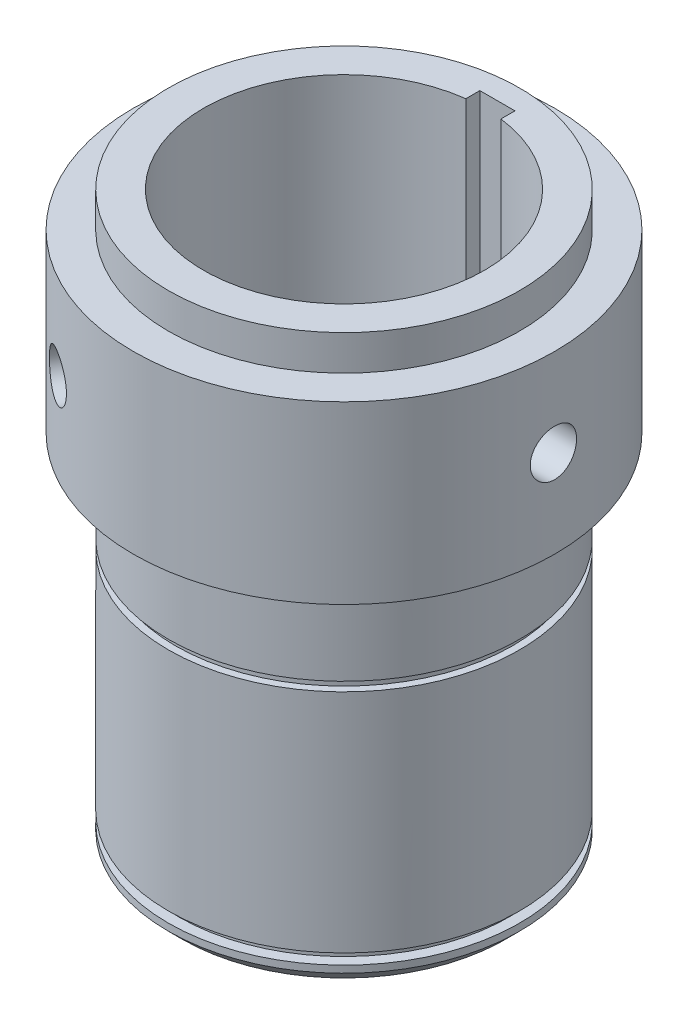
ISO-10303-21;
HEADER;
FILE_DESCRIPTION(('STEP AP214'),'2;1');
FILE_NAME('part.step','',(''),(''),'','','');
FILE_SCHEMA(('AUTOMOTIVE_DESIGN { 1 0 10303 214 1 1 1 1 }'));
ENDSEC;
DATA;
#1=APPLICATION_CONTEXT('core data for automotive mechanical design processes');
#2=APPLICATION_PROTOCOL_DEFINITION('international standard','automotive_design',2000,#1);
#3=PRODUCT_CONTEXT('',#1,'mechanical');
#4=PRODUCT('Part','Part','',(#3));
#5=PRODUCT_RELATED_PRODUCT_CATEGORY('part','',(#4));
#6=PRODUCT_DEFINITION_FORMATION('','',#4);
#7=PRODUCT_DEFINITION_CONTEXT('part definition',#1,'design');
#8=PRODUCT_DEFINITION('design','',#6,#7);
#9=PRODUCT_DEFINITION_SHAPE('','',#8);
#10=(LENGTH_UNIT() NAMED_UNIT(*) SI_UNIT(.MILLI.,.METRE.));
#11=(NAMED_UNIT(*) PLANE_ANGLE_UNIT() SI_UNIT($,.RADIAN.));
#12=(NAMED_UNIT(*) SI_UNIT($,.STERADIAN.) SOLID_ANGLE_UNIT());
#13=UNCERTAINTY_MEASURE_WITH_UNIT(LENGTH_MEASURE(1.E-05),#10,'distance_accuracy_value','');
#14=(GEOMETRIC_REPRESENTATION_CONTEXT(3) GLOBAL_UNCERTAINTY_ASSIGNED_CONTEXT((#13)) GLOBAL_UNIT_ASSIGNED_CONTEXT((#10,
#11,#12)) REPRESENTATION_CONTEXT('',''));
#15=CARTESIAN_POINT('',(0.,0.,0.));
#16=DIRECTION('',(0.,0.,1.));
#17=DIRECTION('',(1.,0.,0.));
#18=AXIS2_PLACEMENT_3D('',#15,#16,#17);
#19=CARTESIAN_POINT('',(0.,69.8663413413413,0.));
#20=DIRECTION('',(0.,1.,0.));
#21=DIRECTION('',(0.,0.,1.));
#22=AXIS2_PLACEMENT_3D('',#19,#20,#21);
#23=CYLINDRICAL_SURFACE('',#22,25.);
#24=CARTESIAN_POINT('',(0.,0.553415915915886,0.));
#25=DIRECTION('',(0.,1.,0.));
#26=DIRECTION('',(0.,0.,1.));
#27=AXIS2_PLACEMENT_3D('',#24,#25,#26);
#28=CIRCLE('',#27,25.);
#29=CARTESIAN_POINT('',(0.,0.553415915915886,25.));
#30=VERTEX_POINT('',#29);
#31=EDGE_CURVE('E124',#30,#30,#28,.T.);
#32=ORIENTED_EDGE('',*,*,#31,.F.);
#33=EDGE_LOOP('',(#32));
#34=FACE_BOUND('',#33,.T.);
#35=CARTESIAN_POINT('',(0.,-12.4465840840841,0.));
#36=DIRECTION('',(0.,-1.,0.));
#37=DIRECTION('',(0.,0.,-1.));
#38=AXIS2_PLACEMENT_3D('',#35,#36,#37);
#39=CIRCLE('',#38,25.);
#40=CARTESIAN_POINT('',(0.,-12.4465840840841,-25.));
#41=VERTEX_POINT('',#40);
#42=EDGE_CURVE('E250',#41,#41,#39,.T.);
#43=ORIENTED_EDGE('',*,*,#42,.F.);
#44=EDGE_LOOP('',(#43));
#45=FACE_BOUND('',#44,.T.);
#46=ADVANCED_FACE('F32',(#34,#45),#23,.T.);
#47=CARTESIAN_POINT('',(25.,-45.9465840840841,0.));
#48=DIRECTION('',(0.,1.,0.));
#49=DIRECTION('',(0.,0.,1.));
#50=AXIS2_PLACEMENT_3D('',#47,#48,#49);
#51=PLANE('',#50);
#52=CARTESIAN_POINT('',(0.,-45.9465840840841,0.));
#53=DIRECTION('',(0.,1.,0.));
#54=DIRECTION('',(0.,0.,1.));
#55=AXIS2_PLACEMENT_3D('',#52,#53,#54);
#56=CIRCLE('',#55,25.);
#57=CARTESIAN_POINT('',(0.,-45.9465840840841,25.));
#58=VERTEX_POINT('',#57);
#59=EDGE_CURVE('E127',#58,#58,#56,.T.);
#60=ORIENTED_EDGE('',*,*,#59,.F.);
#61=EDGE_LOOP('',(#60));
#62=FACE_BOUND('',#61,.T.);
#63=CARTESIAN_POINT('',(0.,-45.9465840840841,0.));
#64=DIRECTION('',(0.,1.,0.));
#65=DIRECTION('',(0.,0.,1.));
#66=AXIS2_PLACEMENT_3D('',#63,#64,#65);
#67=CIRCLE('',#66,23.5);
#68=CARTESIAN_POINT('',(0.,-45.9465840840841,23.5));
#69=VERTEX_POINT('',#68);
#70=EDGE_CURVE('E219',#69,#69,#67,.T.);
#71=ORIENTED_EDGE('',*,*,#70,.T.);
#72=EDGE_LOOP('',(#71));
#73=FACE_BOUND('',#72,.T.);
#74=ADVANCED_FACE('F196',(#62,#73),#51,.F.);
#75=CARTESIAN_POINT('',(0.,-13.7465840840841,0.));
#76=DIRECTION('',(0.,-1.,0.));
#77=DIRECTION('',(0.,0.,-1.));
#78=AXIS2_PLACEMENT_3D('',#75,#76,#77);
#79=CIRCLE('',#78,25.);
#80=CARTESIAN_POINT('',(0.,-13.7465840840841,-25.));
#81=VERTEX_POINT('',#80);
#82=EDGE_CURVE('E36',#81,#81,#79,.T.);
#83=ORIENTED_EDGE('',*,*,#82,.T.);
#84=EDGE_LOOP('',(#83));
#85=FACE_BOUND('',#84,.T.);
#86=ORIENTED_EDGE('',*,*,#59,.T.);
#87=EDGE_LOOP('',(#86));
#88=FACE_BOUND('',#87,.T.);
#89=ADVANCED_FACE('F199',(#85,#88),#23,.T.);
#90=CARTESIAN_POINT('',(25.,0.553415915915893,0.));
#91=DIRECTION('',(0.,1.,0.));
#92=DIRECTION('',(0.,0.,1.));
#93=AXIS2_PLACEMENT_3D('',#90,#91,#92);
#94=PLANE('',#93);
#95=CARTESIAN_POINT('',(0.,0.553415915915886,0.));
#96=DIRECTION('',(0.,1.,0.));
#97=DIRECTION('',(0.,0.,1.));
#98=AXIS2_PLACEMENT_3D('',#95,#96,#97);
#99=CIRCLE('',#98,30.);
#100=CARTESIAN_POINT('',(0.,0.553415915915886,30.));
#101=VERTEX_POINT('',#100);
#102=EDGE_CURVE('E121',#101,#101,#99,.T.);
#103=ORIENTED_EDGE('',*,*,#102,.F.);
#104=EDGE_LOOP('',(#103));
#105=FACE_BOUND('',#104,.T.);
#106=ORIENTED_EDGE('',*,*,#31,.T.);
#107=EDGE_LOOP('',(#106));
#108=FACE_BOUND('',#107,.T.);
#109=ADVANCED_FACE('F191',(#105,#108),#94,.F.);
#110=CARTESIAN_POINT('',(0.,69.8663413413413,0.));
#111=DIRECTION('',(0.,1.,0.));
#112=DIRECTION('',(0.,0.,1.));
#113=AXIS2_PLACEMENT_3D('',#110,#111,#112);
#114=CYLINDRICAL_SURFACE('',#113,30.);
#115=CARTESIAN_POINT('',(-17.7668576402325,13.0534159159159,-24.1731001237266));
#116=CARTESIAN_POINT('',(-17.7668519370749,12.8686560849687,-24.1731061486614));
#117=CARTESIAN_POINT('',(-17.7542425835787,12.6837765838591,-24.1823877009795));
#118=CARTESIAN_POINT('',(-17.7040634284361,12.3191506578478,-24.2191467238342));
#119=CARTESIAN_POINT('',(-17.6664666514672,12.1394099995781,-24.2466438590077));
#120=CARTESIAN_POINT('',(-17.5672126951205,11.7903944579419,-24.3186507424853));
#121=CARTESIAN_POINT('',(-17.5055707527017,11.6211130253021,-24.363149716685));
#122=CARTESIAN_POINT('',(-17.3596823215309,11.2976813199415,-24.4673133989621));
#123=CARTESIAN_POINT('',(-17.275440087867,11.1435282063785,-24.5269752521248));
#124=CARTESIAN_POINT('',(-17.0859462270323,10.8540209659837,-24.6593554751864));
#125=CARTESIAN_POINT('',(-16.9806141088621,10.7187423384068,-24.7321237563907));
#126=CARTESIAN_POINT('',(-16.7516564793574,10.4714750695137,-24.887770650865));
#127=CARTESIAN_POINT('',(-16.6280301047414,10.3594875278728,-24.9706497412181));
#128=CARTESIAN_POINT('',(-16.3651833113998,10.1617161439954,-25.1436981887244));
#129=CARTESIAN_POINT('',(-16.2259239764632,10.0759997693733,-25.2338855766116));
#130=CARTESIAN_POINT('',(-15.9356469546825,9.93363568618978,-25.418195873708));
#131=CARTESIAN_POINT('',(-15.7846296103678,9.87698713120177,-25.5123186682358));
#132=CARTESIAN_POINT('',(-15.47552421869,9.79458994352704,-25.7009880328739));
#133=CARTESIAN_POINT('',(-15.3174674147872,9.76871661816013,-25.7955313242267));
#134=CARTESIAN_POINT('',(-14.9981162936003,9.74821828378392,-25.9825082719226));
#135=CARTESIAN_POINT('',(-14.8368220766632,9.75359230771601,-26.0749419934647));
#136=CARTESIAN_POINT('',(-14.516338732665,9.79533538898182,-26.2547049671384));
#137=CARTESIAN_POINT('',(-14.3571435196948,9.83157035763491,-26.3420545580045));
#138=CARTESIAN_POINT('',(-14.0448109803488,9.93379759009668,-26.5098988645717));
#139=CARTESIAN_POINT('',(-13.89167374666,9.99979030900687,-26.5903934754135));
#140=CARTESIAN_POINT('',(-13.5957161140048,10.1598051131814,-26.7429300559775));
#141=CARTESIAN_POINT('',(-13.4529181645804,10.2538860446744,-26.8149538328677));
#142=CARTESIAN_POINT('',(-13.1823399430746,10.4673639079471,-26.949002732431));
#143=CARTESIAN_POINT('',(-13.0545602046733,10.5867617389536,-27.0110274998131));
#144=CARTESIAN_POINT('',(-12.8173587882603,10.8482371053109,-27.1243935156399));
#145=CARTESIAN_POINT('',(-12.708037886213,10.9904313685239,-27.1756764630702));
#146=CARTESIAN_POINT('',(-12.5120979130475,11.2930599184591,-27.2664464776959));
#147=CARTESIAN_POINT('',(-12.4254788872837,11.453494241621,-27.305933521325));
#148=CARTESIAN_POINT('',(-12.2777859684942,11.78814356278,-27.3726610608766));
#149=CARTESIAN_POINT('',(-12.2167192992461,11.9623624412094,-27.3998980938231));
#150=CARTESIAN_POINT('',(-12.1222487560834,12.319587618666,-27.4418253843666));
#151=CARTESIAN_POINT('',(-12.0888438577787,12.5025935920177,-27.4565161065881));
#152=CARTESIAN_POINT('',(-12.0509547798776,12.8711737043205,-27.4731673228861));
#153=CARTESIAN_POINT('',(-12.0463203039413,13.0567294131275,-27.4751939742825));
#154=CARTESIAN_POINT('',(-12.0657319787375,13.4260404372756,-27.4666747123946));
#155=CARTESIAN_POINT('',(-12.0897776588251,13.609795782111,-27.4561290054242));
#156=CARTESIAN_POINT('',(-12.1656185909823,13.9698091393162,-27.4226077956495));
#157=CARTESIAN_POINT('',(-12.2173423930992,14.1460852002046,-27.3996642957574));
#158=CARTESIAN_POINT('',(-12.3467464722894,14.4866985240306,-27.3415956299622));
#159=CARTESIAN_POINT('',(-12.4244274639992,14.6510354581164,-27.3064701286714));
#160=CARTESIAN_POINT('',(-12.6035591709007,14.9638476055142,-27.2242540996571));
#161=CARTESIAN_POINT('',(-12.705106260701,15.1122548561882,-27.1771149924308));
#162=CARTESIAN_POINT('',(-12.9285253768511,15.3883041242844,-27.0715433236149));
#163=CARTESIAN_POINT('',(-13.0503980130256,15.5159455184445,-27.0131104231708));
#164=CARTESIAN_POINT('',(-13.311215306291,15.7474066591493,-26.8855476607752));
#165=CARTESIAN_POINT('',(-13.4502323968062,15.8511196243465,-26.8163720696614));
#166=CARTESIAN_POINT('',(-13.7405989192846,16.0310435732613,-26.6687538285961));
#167=CARTESIAN_POINT('',(-13.8919481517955,16.1072550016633,-26.5903113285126));
#168=CARTESIAN_POINT('',(-14.2020318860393,16.2298332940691,-26.4259907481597));
#169=CARTESIAN_POINT('',(-14.3607499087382,16.2762636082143,-26.3401289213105));
#170=CARTESIAN_POINT('',(-14.6811273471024,16.3381685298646,-26.1629125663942));
#171=CARTESIAN_POINT('',(-14.8427866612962,16.3536442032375,-26.0715582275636));
#172=CARTESIAN_POINT('',(-15.163479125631,16.3531837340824,-25.8863479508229));
#173=CARTESIAN_POINT('',(-15.3225216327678,16.3374129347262,-25.7925077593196));
#174=CARTESIAN_POINT('',(-15.6344015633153,16.2752552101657,-25.6046605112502));
#175=CARTESIAN_POINT('',(-15.7872389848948,16.2288682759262,-25.5106534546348));
#176=CARTESIAN_POINT('',(-16.0825711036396,16.1068432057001,-25.3255069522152));
#177=CARTESIAN_POINT('',(-16.2250679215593,16.0312110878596,-25.2343669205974));
#178=CARTESIAN_POINT('',(-16.4960971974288,15.8528598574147,-25.0580316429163));
#179=CARTESIAN_POINT('',(-16.6246296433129,15.7501407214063,-24.9728364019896));
#180=CARTESIAN_POINT('',(-16.8651820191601,15.5199138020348,-24.8110215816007));
#181=CARTESIAN_POINT('',(-16.9771148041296,15.3922828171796,-24.7344477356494));
#182=CARTESIAN_POINT('',(-17.1810152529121,15.1161048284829,-24.5932539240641));
#183=CARTESIAN_POINT('',(-17.2729781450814,14.9675528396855,-24.5286368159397));
#184=CARTESIAN_POINT('',(-17.4349755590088,14.6532472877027,-24.4137573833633));
#185=CARTESIAN_POINT('',(-17.5049429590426,14.4874430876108,-24.3635390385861));
#186=CARTESIAN_POINT('',(-17.6208529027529,14.1438040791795,-24.279841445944));
#187=CARTESIAN_POINT('',(-17.6668221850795,13.9659829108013,-24.2463435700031));
#188=CARTESIAN_POINT('',(-17.7224023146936,13.6648909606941,-24.2057258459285));
#189=CARTESIAN_POINT('',(-17.7390537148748,13.5435361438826,-24.1935149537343));
#190=CARTESIAN_POINT('',(-17.7612832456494,13.2992771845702,-24.177200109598));
#191=CARTESIAN_POINT('',(-17.7668614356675,13.1763730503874,-24.1730961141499));
#192=CARTESIAN_POINT('',(-17.7668576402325,13.0534159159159,-24.1731001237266));
#193=B_SPLINE_CURVE_WITH_KNOTS('',3,(#115,#116,#117,#118,#119,#120,#121,#122,#123,#124,#125,
#126,#127,#128,#129,#130,#131,#132,#133,#134,#135,#136,#137,#138,#139,#140,#141,#142,#143,#144,
#145,#146,#147,#148,#149,#150,#151,#152,#153,#154,#155,#156,#157,#158,#159,#160,#161,#162,#163,
#164,#165,#166,#167,#168,#169,#170,#171,#172,#173,#174,#175,#176,#177,#178,#179,#180,#181,#182,
#183,#184,#185,#186,#187,#188,#189,#190,#191,#192),.UNSPECIFIED.,.T.,.F.,(4,2,2,2,2,2,2,2,2,2,2,
2,2,2,2,2,2,2,2,2,2,2,2,2,2,2,2,2,2,2,2,2,2,2,2,2,2,2,4),(0.,0.553830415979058,1.1082596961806,
1.6623382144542,2.21631248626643,2.77244278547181,3.32859933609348,3.88617242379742,
4.44372927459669,4.99901928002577,5.55429210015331,6.1071645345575,6.66004542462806,
7.21409285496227,7.76815996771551,8.32516051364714,8.88216217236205,9.43932119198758,
9.99645957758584,10.5506850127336,11.1049013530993,11.6576938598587,12.2105015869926,
12.7655811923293,13.3206774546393,13.8782049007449,14.4357233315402,14.992049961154,
15.5483574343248,16.1017290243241,16.6551007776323,17.2083587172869,17.7616171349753,
18.3176843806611,18.8738843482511,19.4317655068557,19.9890237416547,20.3575982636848,
20.7261708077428),.UNSPECIFIED.);
#194=CARTESIAN_POINT('',(-17.7668576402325,13.0534159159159,-24.1731001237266));
#195=VERTEX_POINT('',#194);
#196=EDGE_CURVE('E12',#195,#195,#193,.T.);
#197=ORIENTED_EDGE('',*,*,#196,.T.);
#198=EDGE_LOOP('',(#197));
#199=FACE_BOUND('',#198,.T.);
#200=CARTESIAN_POINT('',(-12.0510899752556,13.0534159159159,27.4731001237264));
#201=CARTESIAN_POINT('',(-12.051098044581,12.8686560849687,27.4730981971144));
#202=CARTESIAN_POINT('',(-12.0654407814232,12.6837765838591,27.4668189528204));
#203=CARTESIAN_POINT('',(-12.1223646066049,12.3191506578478,27.4417420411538));
#204=CARTESIAN_POINT('',(-12.1649762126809,12.1394099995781,27.4229308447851));
#205=CARTESIAN_POINT('',(-12.2769629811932,11.7903944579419,27.3729778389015));
#206=CARTESIAN_POINT('',(-12.3463211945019,11.6211130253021,27.3418438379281));
#207=CARTESIAN_POINT('',(-12.509473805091,11.2976813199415,27.2675825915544));
#208=CARTESIAN_POINT('',(-12.6032636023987,11.1435282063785,27.2244576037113));
#209=CARTESIAN_POINT('',(-12.812655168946,10.8540209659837,27.1265412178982));
#210=CARTESIAN_POINT('',(-12.9283404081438,10.7187423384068,27.0717050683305));
#211=CARTESIAN_POINT('',(-13.1776133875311,10.4714750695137,26.9512453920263));
#212=CARTESIAN_POINT('',(-13.3112019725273,10.3594875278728,26.8856213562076));
#213=CARTESIAN_POINT('',(-13.5924897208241,10.1617161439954,26.7445135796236));
#214=CARTESIAN_POINT('',(-13.7402239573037,10.0759997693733,26.669005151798));
#215=CARTESIAN_POINT('',(-14.0449798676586,9.93363568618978,26.5097730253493));
#216=CARTESIAN_POINT('',(-14.2020012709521,9.87698713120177,26.4260495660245));
#217=CARTESIAN_POINT('',(-14.5199464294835,9.79458994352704,26.2526911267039));
#218=CARTESIAN_POINT('',(-14.6808517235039,9.76871661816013,26.1630815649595));
#219=CARTESIAN_POINT('',(-15.002454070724,9.74821828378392,25.9800038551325));
#220=CARTESIAN_POINT('',(-15.1631511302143,9.75359230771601,25.8865358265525));
#221=CARTESIAN_POINT('',(-15.4790721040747,9.79533538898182,25.6988705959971));
#222=CARTESIAN_POINT('',(-15.63431667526,9.83157035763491,25.6046782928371));
#223=CARTESIAN_POINT('',(-15.9358403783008,9.93379759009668,25.4181125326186));
#224=CARTESIAN_POINT('',(-16.082119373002,9.99979030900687,25.3257391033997));
#225=CARTESIAN_POINT('',(-16.3621987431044,10.1598051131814,25.1457005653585));
#226=CARTESIAN_POINT('',(-16.49597213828,10.2538860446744,25.0580458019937));
#227=CARTESIAN_POINT('',(-16.7473510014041,10.4673639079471,24.8907426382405));
#228=CARTESIAN_POINT('',(-16.8649558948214,10.5867617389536,24.8110945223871));
#229=CARTESIAN_POINT('',(-17.0817344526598,10.8482371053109,24.6623550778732));
#230=CARTESIAN_POINT('',(-17.1808072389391,10.9904313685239,24.5933218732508));
#231=CARTESIAN_POINT('',(-17.3573863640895,11.2930599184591,24.4690178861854));
#232=CARTESIAN_POINT('',(-17.4348926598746,11.453494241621,24.4137471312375));
#233=CARTESIAN_POINT('',(-17.566526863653,11.78814356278,24.3192050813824));
#234=CARTESIAN_POINT('',(-17.6206481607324,11.9623624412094,24.2799383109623));
#235=CARTESIAN_POINT('',(-17.7041935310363,12.319587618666,24.2190880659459));
#236=CARTESIAN_POINT('',(-17.7336185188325,12.5025935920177,24.197503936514));
#237=CARTESIAN_POINT('',(-17.7669834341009,12.8711737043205,24.1730166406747));
#238=CARTESIAN_POINT('',(-17.771055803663,13.0567294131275,24.1700163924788));
#239=CARTESIAN_POINT('',(-17.7539720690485,13.4260404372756,24.1825677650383));
#240=CARTESIAN_POINT('',(-17.7328163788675,13.609795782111,24.1981190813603));
#241=CARTESIAN_POINT('',(-17.6658656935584,13.9698091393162,24.2470386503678));
#242=CARTESIAN_POINT('',(-17.6201341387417,14.1460852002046,24.2803610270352));
#243=CARTESIAN_POINT('',(-17.5051431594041,14.4866985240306,24.3633939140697));
#244=CARTESIAN_POINT('',(-17.4358830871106,14.6510354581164,24.4131048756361));
#245=CARTESIAN_POINT('',(-17.2751160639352,14.9638476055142,24.527129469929));
#246=CARTESIAN_POINT('',(-17.1835188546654,15.1122548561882,24.5915022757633));
#247=CARTESIAN_POINT('',(-16.9803815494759,15.3883041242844,24.7322030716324));
#248=CARTESIAN_POINT('',(-16.8688408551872,15.5159455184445,24.8085314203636));
#249=CARTESIAN_POINT('',(-16.627959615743,15.7474066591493,24.9706244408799));
#250=CARTESIAN_POINT('',(-16.498543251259,15.8511196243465,25.0564289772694));
#251=CARTESIAN_POINT('',(-16.2255188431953,16.0310435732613,25.2340846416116));
#252=CARTESIAN_POINT('',(-16.0819110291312,16.1072550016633,25.3259356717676));
#253=CARTESIAN_POINT('',(-15.7845633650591,16.2298332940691,25.5123157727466));
#254=CARTESIAN_POINT('',(-15.6308458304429,16.2762636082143,25.6068386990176));
#255=CARTESIAN_POINT('',(-15.3171832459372,16.3381685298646,25.7956855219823));
#256=CARTESIAN_POINT('',(-15.1572384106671,16.3536442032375,25.8900094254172));
#257=CARTESIAN_POINT('',(-14.8364953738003,16.3531837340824,26.075132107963));
#258=CARTESIAN_POINT('',(-14.6757061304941,16.3374129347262,26.1659468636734));
#259=CARTESIAN_POINT('',(-14.3570856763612,16.2752552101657,26.3421191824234));
#260=CARTESIAN_POINT('',(-14.1992544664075,16.2288682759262,26.4274767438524));
#261=CARTESIAN_POINT('',(-13.8912468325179,16.1068432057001,26.5906686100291));
#262=CARTESIAN_POINT('',(-13.7410688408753,16.0312110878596,26.6685044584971));
#263=CARTESIAN_POINT('',(-13.4528433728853,15.8528598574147,26.8150550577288));
#264=CARTESIAN_POINT('',(-13.3147959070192,15.7501407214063,26.8837698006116));
#265=CARTESIAN_POINT('',(-13.05438397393,15.5199138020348,27.0111868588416));
#266=CARTESIAN_POINT('',(-12.9321026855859,15.3922828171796,27.0698365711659));
#267=CARTESIAN_POINT('',(-12.7078750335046,15.1161048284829,27.1758226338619));
#268=CARTESIAN_POINT('',(-12.6059335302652,14.9675528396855,27.2231562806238));
#269=CARTESIAN_POINT('',(-12.425446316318,14.6532472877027,27.3060104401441));
#270=CARTESIAN_POINT('',(-12.346972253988,14.4874430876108,27.3414948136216));
#271=CARTESIAN_POINT('',(-12.2165330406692,14.1438040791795,27.4000269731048));
#272=CARTESIAN_POINT('',(-12.1645383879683,13.9659829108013,27.4230886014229));
#273=CARTESIAN_POINT('',(-12.1015723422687,13.6648909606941,27.4509135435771));
#274=CARTESIAN_POINT('',(-12.0826716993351,13.5435361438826,27.4592286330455));
#275=CARTESIAN_POINT('',(-12.0574278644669,13.2992771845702,27.4703225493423));
#276=CARTESIAN_POINT('',(-12.0510846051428,13.1763730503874,27.4731014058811));
#277=CARTESIAN_POINT('',(-12.0510899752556,13.0534159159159,27.4731001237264));
#278=B_SPLINE_CURVE_WITH_KNOTS('',3,(#200,#201,#202,#203,#204,#205,#206,#207,#208,#209,#210,
#211,#212,#213,#214,#215,#216,#217,#218,#219,#220,#221,#222,#223,#224,#225,#226,#227,#228,#229,
#230,#231,#232,#233,#234,#235,#236,#237,#238,#239,#240,#241,#242,#243,#244,#245,#246,#247,#248,
#249,#250,#251,#252,#253,#254,#255,#256,#257,#258,#259,#260,#261,#262,#263,#264,#265,#266,#267,
#268,#269,#270,#271,#272,#273,#274,#275,#276,#277),.UNSPECIFIED.,.T.,.F.,(4,2,2,2,2,2,2,2,2,2,2,
2,2,2,2,2,2,2,2,2,2,2,2,2,2,2,2,2,2,2,2,2,2,2,2,2,2,2,4),(0.,0.553830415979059,1.1082596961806,
1.6623382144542,2.21631248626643,2.77244278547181,3.32859933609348,3.88617242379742,
4.44372927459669,4.99901928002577,5.55429210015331,6.1071645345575,6.66004542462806,
7.21409285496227,7.76815996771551,8.32516051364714,8.88216217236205,9.43932119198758,
9.99645957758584,10.5506850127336,11.1049013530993,11.6576938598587,12.2105015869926,
12.7655811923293,13.3206774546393,13.8782049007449,14.4357233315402,14.992049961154,
15.5483574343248,16.1017290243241,16.6551007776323,17.2083587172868,17.7616171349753,
18.3176843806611,18.8738843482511,19.4317655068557,19.9890237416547,20.3575982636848,
20.7261708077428),.UNSPECIFIED.);
#279=CARTESIAN_POINT('',(-12.0510899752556,13.0534159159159,27.4731001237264));
#280=VERTEX_POINT('',#279);
#281=EDGE_CURVE('E41',#280,#280,#278,.T.);
#282=ORIENTED_EDGE('',*,*,#281,.T.);
#283=EDGE_LOOP('',(#282));
#284=FACE_BOUND('',#283,.T.);
#285=CARTESIAN_POINT('',(29.8179476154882,13.0534159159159,-3.29999999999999));
#286=CARTESIAN_POINT('',(29.817949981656,12.8686560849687,-3.29999204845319));
#287=CARTESIAN_POINT('',(29.819683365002,12.6837765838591,-3.28443125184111));
#288=CARTESIAN_POINT('',(29.8264280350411,12.3191506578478,-3.22259531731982));
#289=CARTESIAN_POINT('',(29.8314428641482,12.1394099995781,-3.17628698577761));
#290=CARTESIAN_POINT('',(29.8441756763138,11.7903944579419,-3.05432709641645));
#291=CARTESIAN_POINT('',(29.8518919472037,11.6211130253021,-2.97869412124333));
#292=CARTESIAN_POINT('',(29.8691561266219,11.2976813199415,-2.80026919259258));
#293=CARTESIAN_POINT('',(29.8787036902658,11.1435282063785,-2.69748235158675));
#294=CARTESIAN_POINT('',(29.8986013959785,10.8540209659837,-2.46718574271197));
#295=CARTESIAN_POINT('',(29.908954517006,10.7187423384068,-2.33958131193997));
#296=CARTESIAN_POINT('',(29.9292698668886,10.4714750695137,-2.06347474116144));
#297=CARTESIAN_POINT('',(29.9392320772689,10.3594875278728,-1.91497161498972));
#298=CARTESIAN_POINT('',(29.957673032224,10.1617161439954,-1.60081539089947));
#299=CARTESIAN_POINT('',(29.9661479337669,10.0759997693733,-1.43511957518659));
#300=CARTESIAN_POINT('',(29.9806268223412,9.93363568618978,-1.09157715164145));
#301=CARTESIAN_POINT('',(29.98663088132,9.87698713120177,-0.913730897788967));
#302=CARTESIAN_POINT('',(29.9954706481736,9.79458994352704,-0.551703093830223));
#303=CARTESIAN_POINT('',(29.9983191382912,9.76871661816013,-0.367550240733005));
#304=CARTESIAN_POINT('',(30.0005703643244,9.74821828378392,0.00250441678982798));
#305=CARTESIAN_POINT('',(29.9999732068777,9.75359230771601,0.188406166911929));
#306=CARTESIAN_POINT('',(29.9954108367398,9.79533538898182,0.555834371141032));
#307=CARTESIAN_POINT('',(29.9914601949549,9.83157035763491,0.737376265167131));
#308=CARTESIAN_POINT('',(29.9806513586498,9.93379759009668,1.09178633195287));
#309=CARTESIAN_POINT('',(29.9737931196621,9.99979030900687,1.2646543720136));
#310=CARTESIAN_POINT('',(29.9579148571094,10.1598051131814,1.59722949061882));
#311=CARTESIAN_POINT('',(29.9488903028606,10.2538860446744,1.75690803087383));
#312=CARTESIAN_POINT('',(29.9296909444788,10.4673639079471,2.05826009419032));
#313=CARTESIAN_POINT('',(29.9195160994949,10.5867617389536,2.19993297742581));
#314=CARTESIAN_POINT('',(29.8990932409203,10.8482371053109,2.46203843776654));
#315=CARTESIAN_POINT('',(29.8888451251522,10.9904313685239,2.5823545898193));
#316=CARTESIAN_POINT('',(29.8694842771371,11.2930599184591,2.79742859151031));
#317=CARTESIAN_POINT('',(29.8603715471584,11.453494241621,2.89218639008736));
#318=CARTESIAN_POINT('',(29.8443128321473,11.78814356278,3.05345597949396));
#319=CARTESIAN_POINT('',(29.8373674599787,11.9623624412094,3.11995978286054));
#320=CARTESIAN_POINT('',(29.8264422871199,12.319587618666,3.22273731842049));
#321=CARTESIAN_POINT('',(29.8224623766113,12.5025935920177,3.25901217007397));
#322=CARTESIAN_POINT('',(29.8179382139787,12.8711737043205,3.30015068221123));
#323=CARTESIAN_POINT('',(29.8173761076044,13.0567294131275,3.30517758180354));
#324=CARTESIAN_POINT('',(29.8197040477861,13.4260404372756,3.28410694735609));
#325=CARTESIAN_POINT('',(29.8225940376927,13.609795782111,3.25800992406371));
#326=CARTESIAN_POINT('',(29.8314842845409,13.9698091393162,3.17556914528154));
#327=CARTESIAN_POINT('',(29.837476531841,14.1460852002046,3.11930326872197));
#328=CARTESIAN_POINT('',(29.8518896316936,14.4866985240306,2.9782017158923));
#329=CARTESIAN_POINT('',(29.8603105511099,14.6510354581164,2.89336525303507));
#330=CARTESIAN_POINT('',(29.8786752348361,14.9638476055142,2.69712462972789));
#331=CARTESIAN_POINT('',(29.8886251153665,15.1122548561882,2.58561271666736));
#332=CARTESIAN_POINT('',(29.9089069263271,15.3883041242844,2.33934025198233));
#333=CARTESIAN_POINT('',(29.9192388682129,15.5159455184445,2.20457900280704));
#334=CARTESIAN_POINT('',(29.9391749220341,15.7474066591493,1.91492321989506));
#335=CARTESIAN_POINT('',(29.9487756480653,15.8511196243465,1.75994309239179));
#336=CARTESIAN_POINT('',(29.9661177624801,16.0310435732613,1.43466918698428));
#337=CARTESIAN_POINT('',(29.9738591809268,16.1072550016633,1.2643756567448));
#338=CARTESIAN_POINT('',(29.9865952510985,16.2298332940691,0.913674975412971));
#339=CARTESIAN_POINT('',(29.9915957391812,16.2762636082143,0.73329022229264));
#340=CARTESIAN_POINT('',(29.9983105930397,16.3381685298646,0.367227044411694));
#341=CARTESIAN_POINT('',(30.0000250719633,16.3536442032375,0.181548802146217));
#342=CARTESIAN_POINT('',(29.9999744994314,16.3531837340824,-0.188784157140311));
#343=CARTESIAN_POINT('',(29.9982277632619,16.3374129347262,-0.373439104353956));
#344=CARTESIAN_POINT('',(29.9914872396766,16.2752552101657,-0.73745867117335));
#345=CARTESIAN_POINT('',(29.9864934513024,16.2288682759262,-0.916823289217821));
#346=CARTESIAN_POINT('',(29.9738179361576,16.1068432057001,-1.26516165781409));
#347=CARTESIAN_POINT('',(29.9661367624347,16.0312110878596,-1.43413753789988));
#348=CARTESIAN_POINT('',(29.9489405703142,15.8528598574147,-1.75702341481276));
#349=CARTESIAN_POINT('',(29.9394255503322,15.7501407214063,-1.91093339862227));
#350=CARTESIAN_POINT('',(29.9195659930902,15.5199138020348,-2.20016527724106));
#351=CARTESIAN_POINT('',(29.9092174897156,15.3922828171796,-2.33538883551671));
#352=CARTESIAN_POINT('',(29.8888902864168,15.1161048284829,-2.58256870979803));
#353=CARTESIAN_POINT('',(29.8789116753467,14.9675528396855,-2.69451946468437));
#354=CARTESIAN_POINT('',(29.8604218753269,14.6532472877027,-2.89225305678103));
#355=CARTESIAN_POINT('',(29.8519152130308,14.4874430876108,-2.97795577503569));
#356=CARTESIAN_POINT('',(29.8373859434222,14.1438040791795,-3.12018552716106));
#357=CARTESIAN_POINT('',(29.8313605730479,13.9659829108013,-3.17674503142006));
#358=CARTESIAN_POINT('',(29.8239746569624,13.6648909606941,-3.24518769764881));
#359=CARTESIAN_POINT('',(29.82172541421,13.5435361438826,-3.26571367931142));
#360=CARTESIAN_POINT('',(29.8187111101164,13.2992771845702,-3.29312243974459));
#361=CARTESIAN_POINT('',(29.8179460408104,13.1763730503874,-3.30000529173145));
#362=CARTESIAN_POINT('',(29.8179476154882,13.0534159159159,-3.29999999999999));
#363=B_SPLINE_CURVE_WITH_KNOTS('',3,(#285,#286,#287,#288,#289,#290,#291,#292,#293,#294,#295,
#296,#297,#298,#299,#300,#301,#302,#303,#304,#305,#306,#307,#308,#309,#310,#311,#312,#313,#314,
#315,#316,#317,#318,#319,#320,#321,#322,#323,#324,#325,#326,#327,#328,#329,#330,#331,#332,#333,
#334,#335,#336,#337,#338,#339,#340,#341,#342,#343,#344,#345,#346,#347,#348,#349,#350,#351,#352,
#353,#354,#355,#356,#357,#358,#359,#360,#361,#362),.UNSPECIFIED.,.T.,.F.,(4,2,2,2,2,2,2,2,2,2,2,
2,2,2,2,2,2,2,2,2,2,2,2,2,2,2,2,2,2,2,2,2,2,2,2,2,2,2,4),(0.,0.553830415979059,1.1082596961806,
1.6623382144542,2.21631248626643,2.77244278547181,3.32859933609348,3.88617242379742,
4.44372927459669,4.99901928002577,5.55429210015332,6.1071645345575,6.66004542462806,
7.21409285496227,7.76815996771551,8.32516051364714,8.88216217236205,9.43932119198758,
9.99645957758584,10.5506850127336,11.1049013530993,11.6576938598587,12.2105015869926,
12.7655811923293,13.3206774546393,13.8782049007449,14.4357233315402,14.992049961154,
15.5483574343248,16.101729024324,16.6551007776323,17.2083587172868,17.7616171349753,
18.3176843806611,18.8738843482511,19.4317655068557,19.9890237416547,20.3575982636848,
20.7261708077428),.UNSPECIFIED.);
#364=CARTESIAN_POINT('',(29.8179476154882,13.0534159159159,-3.29999999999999));
#365=VERTEX_POINT('',#364);
#366=EDGE_CURVE('E136',#365,#365,#363,.T.);
#367=ORIENTED_EDGE('',*,*,#366,.T.);
#368=EDGE_LOOP('',(#367));
#369=FACE_BOUND('',#368,.T.);
#370=CARTESIAN_POINT('',(0.,25.5534159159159,0.));
#371=DIRECTION('',(0.,1.,0.));
#372=DIRECTION('',(0.,0.,1.));
#373=AXIS2_PLACEMENT_3D('',#370,#371,#372);
#374=CIRCLE('',#373,30.);
#375=CARTESIAN_POINT('',(0.,25.5534159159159,30.));
#376=VERTEX_POINT('',#375);
#377=EDGE_CURVE('E118',#376,#376,#374,.T.);
#378=ORIENTED_EDGE('',*,*,#377,.F.);
#379=EDGE_LOOP('',(#378));
#380=FACE_BOUND('',#379,.T.);
#381=ORIENTED_EDGE('',*,*,#102,.T.);
#382=EDGE_LOOP('',(#381));
#383=FACE_BOUND('',#382,.T.);
#384=ADVANCED_FACE('F146',(#199,#284,#369,#380,#383),#114,.T.);
#385=CARTESIAN_POINT('',(30.,25.5534159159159,0.));
#386=DIRECTION('',(0.,-1.,0.));
#387=DIRECTION('',(0.,0.,-1.));
#388=AXIS2_PLACEMENT_3D('',#385,#386,#387);
#389=PLANE('',#388);
#390=CARTESIAN_POINT('',(0.,25.5534159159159,0.));
#391=DIRECTION('',(0.,1.,0.));
#392=DIRECTION('',(0.,0.,1.));
#393=AXIS2_PLACEMENT_3D('',#390,#391,#392);
#394=CIRCLE('',#393,25.);
#395=CARTESIAN_POINT('',(0.,25.5534159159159,25.));
#396=VERTEX_POINT('',#395);
#397=EDGE_CURVE('E115',#396,#396,#394,.T.);
#398=ORIENTED_EDGE('',*,*,#397,.F.);
#399=EDGE_LOOP('',(#398));
#400=FACE_BOUND('',#399,.T.);
#401=ORIENTED_EDGE('',*,*,#377,.T.);
#402=EDGE_LOOP('',(#401));
#403=FACE_BOUND('',#402,.T.);
#404=ADVANCED_FACE('F184',(#400,#403),#389,.F.);
#405=CARTESIAN_POINT('',(0.,69.8663413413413,0.));
#406=DIRECTION('',(0.,1.,0.));
#407=DIRECTION('',(0.,0.,1.));
#408=AXIS2_PLACEMENT_3D('',#405,#406,#407);
#409=CYLINDRICAL_SURFACE('',#408,25.);
#410=CARTESIAN_POINT('',(0.,30.5534159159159,0.));
#411=DIRECTION('',(0.,1.,0.));
#412=DIRECTION('',(0.,0.,1.));
#413=AXIS2_PLACEMENT_3D('',#410,#411,#412);
#414=CIRCLE('',#413,25.);
#415=CARTESIAN_POINT('',(0.,30.5534159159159,25.));
#416=VERTEX_POINT('',#415);
#417=EDGE_CURVE('E106',#416,#416,#414,.T.);
#418=ORIENTED_EDGE('',*,*,#417,.F.);
#419=EDGE_LOOP('',(#418));
#420=FACE_BOUND('',#419,.T.);
#421=ORIENTED_EDGE('',*,*,#397,.T.);
#422=EDGE_LOOP('',(#421));
#423=FACE_BOUND('',#422,.T.);
#424=ADVANCED_FACE('F181',(#420,#423),#409,.T.);
#425=CARTESIAN_POINT('',(25.,30.5534159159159,0.));
#426=DIRECTION('',(0.,-1.,0.));
#427=DIRECTION('',(0.,0.,-1.));
#428=AXIS2_PLACEMENT_3D('',#425,#426,#427);
#429=PLANE('',#428);
#430=CARTESIAN_POINT('',(0.,30.5534159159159,0.));
#431=DIRECTION('',(0.,1.,0.));
#432=DIRECTION('',(0.,0.,1.));
#433=AXIS2_PLACEMENT_3D('',#430,#431,#432);
#434=CIRCLE('',#433,20.);
#435=CARTESIAN_POINT('',(-2.5,30.5534159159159,-19.8431348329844));
#436=VERTEX_POINT('',#435);
#437=CARTESIAN_POINT('',(2.5,30.5534159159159,-19.8431348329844));
#438=VERTEX_POINT('',#437);
#439=EDGE_CURVE('E103',#436,#438,#434,.T.);
#440=ORIENTED_EDGE('',*,*,#439,.F.);
#441=DIRECTION('',(0.,0.,1.));
#442=VECTOR('',#441,1.);
#443=CARTESIAN_POINT('',(-2.5,30.5534159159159,-19.8431348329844));
#444=LINE('',#443,#442);
#445=CARTESIAN_POINT('',(-2.5,30.5534159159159,-21.8431348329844));
#446=VERTEX_POINT('',#445);
#447=EDGE_CURVE('E86',#446,#436,#444,.T.);
#448=ORIENTED_EDGE('',*,*,#447,.F.);
#449=DIRECTION('',(-1.,0.,0.));
#450=VECTOR('',#449,1.);
#451=CARTESIAN_POINT('',(-2.5,30.5534159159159,-21.8431348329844));
#452=LINE('',#451,#450);
#453=CARTESIAN_POINT('',(2.5,30.5534159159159,-21.8431348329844));
#454=VERTEX_POINT('',#453);
#455=EDGE_CURVE('E99',#454,#446,#452,.T.);
#456=ORIENTED_EDGE('',*,*,#455,.F.);
#457=DIRECTION('',(0.,0.,-1.));
#458=VECTOR('',#457,1.);
#459=CARTESIAN_POINT('',(2.5,30.5534159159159,-19.8431348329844));
#460=LINE('',#459,#458);
#461=EDGE_CURVE('E239',#438,#454,#460,.T.);
#462=ORIENTED_EDGE('',*,*,#461,.F.);
#463=EDGE_LOOP('',(#440,#448,#456,#462));
#464=FACE_BOUND('',#463,.T.);
#465=ORIENTED_EDGE('',*,*,#417,.T.);
#466=EDGE_LOOP('',(#465));
#467=FACE_BOUND('',#466,.T.);
#468=ADVANCED_FACE('F178',(#464,#467),#429,.F.);
#469=CARTESIAN_POINT('',(0.,69.8663413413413,0.));
#470=DIRECTION('',(0.,1.,0.));
#471=DIRECTION('',(0.,0.,1.));
#472=AXIS2_PLACEMENT_3D('',#469,#470,#471);
#473=CYLINDRICAL_SURFACE('',#472,20.);
#474=ORIENTED_EDGE('',*,*,#439,.T.);
#475=DIRECTION('',(0.,1.,0.));
#476=VECTOR('',#475,1.);
#477=CARTESIAN_POINT('',(2.5,-50.4465840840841,-19.8431348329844));
#478=LINE('',#477,#476);
#479=CARTESIAN_POINT('',(2.5,-50.4465840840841,-19.8431348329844));
#480=VERTEX_POINT('',#479);
#481=EDGE_CURVE('E91',#480,#438,#478,.T.);
#482=ORIENTED_EDGE('',*,*,#481,.F.);
#483=CARTESIAN_POINT('',(0.,-50.4465840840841,0.));
#484=DIRECTION('',(0.,1.,0.));
#485=DIRECTION('',(0.,0.,1.));
#486=AXIS2_PLACEMENT_3D('',#483,#484,#485);
#487=CIRCLE('',#486,20.);
#488=CARTESIAN_POINT('',(-2.5,-50.4465840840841,-19.8431348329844));
#489=VERTEX_POINT('',#488);
#490=EDGE_CURVE('E97',#489,#480,#487,.T.);
#491=ORIENTED_EDGE('',*,*,#490,.F.);
#492=DIRECTION('',(0.,1.,0.));
#493=VECTOR('',#492,1.);
#494=CARTESIAN_POINT('',(-2.5,-50.4465840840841,-19.8431348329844));
#495=LINE('',#494,#493);
#496=EDGE_CURVE('E81',#489,#436,#495,.T.);
#497=ORIENTED_EDGE('',*,*,#496,.T.);
#498=EDGE_LOOP('',(#474,#482,#491,#497));
#499=FACE_BOUND('',#498,.T.);
#500=ADVANCED_FACE('F102',(#499),#473,.F.);
#501=CARTESIAN_POINT('',(20.,-50.4465840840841,0.));
#502=DIRECTION('',(0.,1.,0.));
#503=DIRECTION('',(0.,0.,1.));
#504=AXIS2_PLACEMENT_3D('',#501,#502,#503);
#505=PLANE('',#504);
#506=CARTESIAN_POINT('',(0.,-50.4465840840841,0.));
#507=DIRECTION('',(0.,1.,0.));
#508=DIRECTION('',(0.,0.,1.));
#509=AXIS2_PLACEMENT_3D('',#506,#507,#508);
#510=CIRCLE('',#509,23.);
#511=CARTESIAN_POINT('',(0.,-50.4465840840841,23.));
#512=VERTEX_POINT('',#511);
#513=EDGE_CURVE('E133',#512,#512,#510,.F.);
#514=ORIENTED_EDGE('',*,*,#513,.T.);
#515=EDGE_LOOP('',(#514));
#516=FACE_BOUND('',#515,.T.);
#517=DIRECTION('',(-1.,0.,0.));
#518=VECTOR('',#517,1.);
#519=CARTESIAN_POINT('',(-2.5,-50.4465840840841,-21.8431348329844));
#520=LINE('',#519,#518);
#521=CARTESIAN_POINT('',(2.5,-50.4465840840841,-21.8431348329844));
#522=VERTEX_POINT('',#521);
#523=CARTESIAN_POINT('',(-2.5,-50.4465840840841,-21.8431348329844));
#524=VERTEX_POINT('',#523);
#525=EDGE_CURVE('E49',#522,#524,#520,.T.);
#526=ORIENTED_EDGE('',*,*,#525,.T.);
#527=DIRECTION('',(0.,0.,1.));
#528=VECTOR('',#527,1.);
#529=CARTESIAN_POINT('',(-2.5,-50.4465840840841,-19.8431348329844));
#530=LINE('',#529,#528);
#531=EDGE_CURVE('E84',#524,#489,#530,.T.);
#532=ORIENTED_EDGE('',*,*,#531,.T.);
#533=ORIENTED_EDGE('',*,*,#490,.T.);
#534=DIRECTION('',(0.,0.,-1.));
#535=VECTOR('',#534,1.);
#536=CARTESIAN_POINT('',(2.5,-50.4465840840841,-19.8431348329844));
#537=LINE('',#536,#535);
#538=EDGE_CURVE('E98',#480,#522,#537,.T.);
#539=ORIENTED_EDGE('',*,*,#538,.T.);
#540=EDGE_LOOP('',(#526,#532,#533,#539));
#541=FACE_BOUND('',#540,.T.);
#542=ADVANCED_FACE('F95',(#516,#541),#505,.F.);
#543=CARTESIAN_POINT('',(0.,69.8663413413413,0.));
#544=DIRECTION('',(0.,1.,0.));
#545=DIRECTION('',(0.,0.,1.));
#546=AXIS2_PLACEMENT_3D('',#543,#544,#545);
#547=CYLINDRICAL_SURFACE('',#546,25.);
#548=CARTESIAN_POINT('',(0.,-48.4465840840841,0.));
#549=DIRECTION('',(0.,1.,0.));
#550=DIRECTION('',(0.,0.,1.));
#551=AXIS2_PLACEMENT_3D('',#548,#549,#550);
#552=CIRCLE('',#551,25.);
#553=CARTESIAN_POINT('',(0.,-48.4465840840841,25.));
#554=VERTEX_POINT('',#553);
#555=EDGE_CURVE('E130',#554,#554,#552,.T.);
#556=ORIENTED_EDGE('',*,*,#555,.T.);
#557=EDGE_LOOP('',(#556));
#558=FACE_BOUND('',#557,.T.);
#559=CARTESIAN_POINT('',(0.,-47.4465840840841,0.));
#560=DIRECTION('',(0.,1.,0.));
#561=DIRECTION('',(0.,0.,1.));
#562=AXIS2_PLACEMENT_3D('',#559,#560,#561);
#563=CIRCLE('',#562,25.);
#564=CARTESIAN_POINT('',(0.,-47.4465840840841,25.));
#565=VERTEX_POINT('',#564);
#566=EDGE_CURVE('E104',#565,#565,#563,.T.);
#567=ORIENTED_EDGE('',*,*,#566,.F.);
#568=EDGE_LOOP('',(#567));
#569=FACE_BOUND('',#568,.T.);
#570=ADVANCED_FACE('F168',(#558,#569),#547,.T.);
#571=CARTESIAN_POINT('',(23.5,-47.4465840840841,0.));
#572=DIRECTION('',(0.,-1.,0.));
#573=DIRECTION('',(0.,0.,-1.));
#574=AXIS2_PLACEMENT_3D('',#571,#572,#573);
#575=PLANE('',#574);
#576=CARTESIAN_POINT('',(0.,-47.4465840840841,0.));
#577=DIRECTION('',(0.,1.,0.));
#578=DIRECTION('',(0.,0.,1.));
#579=AXIS2_PLACEMENT_3D('',#576,#577,#578);
#580=CIRCLE('',#579,23.5);
#581=CARTESIAN_POINT('',(0.,-47.4465840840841,23.5));
#582=VERTEX_POINT('',#581);
#583=EDGE_CURVE('E109',#582,#582,#580,.T.);
#584=ORIENTED_EDGE('',*,*,#583,.F.);
#585=EDGE_LOOP('',(#584));
#586=FACE_BOUND('',#585,.T.);
#587=ORIENTED_EDGE('',*,*,#566,.T.);
#588=EDGE_LOOP('',(#587));
#589=FACE_BOUND('',#588,.T.);
#590=ADVANCED_FACE('F164',(#586,#589),#575,.F.);
#591=CARTESIAN_POINT('',(0.,69.8663413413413,0.));
#592=DIRECTION('',(0.,1.,0.));
#593=DIRECTION('',(0.,0.,1.));
#594=AXIS2_PLACEMENT_3D('',#591,#592,#593);
#595=CYLINDRICAL_SURFACE('',#594,23.5);
#596=ORIENTED_EDGE('',*,*,#70,.F.);
#597=EDGE_LOOP('',(#596));
#598=FACE_BOUND('',#597,.T.);
#599=ORIENTED_EDGE('',*,*,#583,.T.);
#600=EDGE_LOOP('',(#599));
#601=FACE_BOUND('',#600,.T.);
#602=ADVANCED_FACE('F161',(#598,#601),#595,.T.);
#603=CARTESIAN_POINT('',(0.,-48.4465840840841,0.));
#604=DIRECTION('',(0.,1.,0.));
#605=DIRECTION('',(0.,0.,1.));
#606=AXIS2_PLACEMENT_3D('',#603,#604,#605);
#607=CONICAL_SURFACE('',#606,25.,0.78539816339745);
#608=ORIENTED_EDGE('',*,*,#513,.F.);
#609=EDGE_LOOP('',(#608));
#610=FACE_BOUND('',#609,.T.);
#611=ORIENTED_EDGE('',*,*,#555,.F.);
#612=EDGE_LOOP('',(#611));
#613=FACE_BOUND('',#612,.T.);
#614=ADVANCED_FACE('F34',(#610,#613),#607,.T.);
#615=CARTESIAN_POINT('',(30.,13.0534159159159,0.));
#616=DIRECTION('',(1.,0.,0.));
#617=DIRECTION('',(0.,0.,-1.));
#618=AXIS2_PLACEMENT_3D('',#615,#616,#617);
#619=CYLINDRICAL_SURFACE('',#618,3.29999999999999);
#620=CARTESIAN_POINT('',(23.,13.0534159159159,0.));
#621=DIRECTION('',(1.,0.,0.));
#622=DIRECTION('',(0.,0.,-1.));
#623=AXIS2_PLACEMENT_3D('',#620,#621,#622);
#624=CIRCLE('',#623,3.3);
#625=CARTESIAN_POINT('',(23.,13.0534159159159,-3.3));
#626=VERTEX_POINT('',#625);
#627=EDGE_CURVE('E220',#626,#626,#624,.T.);
#628=ORIENTED_EDGE('',*,*,#627,.F.);
#629=EDGE_LOOP('',(#628));
#630=FACE_BOUND('',#629,.T.);
#631=ORIENTED_EDGE('',*,*,#366,.F.);
#632=EDGE_LOOP('',(#631));
#633=FACE_BOUND('',#632,.T.);
#634=ADVANCED_FACE('F150',(#630,#633),#619,.F.);
#635=CARTESIAN_POINT('',(23.,13.0534159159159,0.));
#636=DIRECTION('',(1.,0.,0.));
#637=DIRECTION('',(0.,0.,-1.));
#638=AXIS2_PLACEMENT_3D('',#635,#636,#637);
#639=CONICAL_SURFACE('',#638,3.3,1.02974425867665);
#640=CARTESIAN_POINT('',(21.0171599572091,13.0534159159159,0.));
#641=VERTEX_POINT('',#640);
#642=VERTEX_LOOP('',#641);
#643=FACE_BOUND('',#642,.T.);
#644=ORIENTED_EDGE('',*,*,#627,.T.);
#645=EDGE_LOOP('',(#644));
#646=FACE_BOUND('',#645,.T.);
#647=ADVANCED_FACE('F155',(#643,#646),#639,.F.);
#648=CARTESIAN_POINT('',(-15.0000000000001,13.0534159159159,25.9807621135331));
#649=DIRECTION('',(-0.500000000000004,0.,0.866025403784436));
#650=DIRECTION('',(0.866025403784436,0.,0.500000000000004));
#651=AXIS2_PLACEMENT_3D('',#648,#649,#650);
#652=CYLINDRICAL_SURFACE('',#651,3.29999999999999);
#653=CARTESIAN_POINT('',(-11.5000000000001,13.0534159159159,19.918584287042));
#654=DIRECTION('',(-0.500000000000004,0.,0.866025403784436));
#655=DIRECTION('',(0.866025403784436,0.,0.500000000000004));
#656=AXIS2_PLACEMENT_3D('',#653,#654,#655);
#657=CIRCLE('',#656,3.3);
#658=CARTESIAN_POINT('',(-8.64211616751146,13.0534159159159,21.5685842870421));
#659=VERTEX_POINT('',#658);
#660=EDGE_CURVE('E224',#659,#659,#657,.T.);
#661=ORIENTED_EDGE('',*,*,#660,.F.);
#662=EDGE_LOOP('',(#661));
#663=FACE_BOUND('',#662,.T.);
#664=ORIENTED_EDGE('',*,*,#281,.F.);
#665=EDGE_LOOP('',(#664));
#666=FACE_BOUND('',#665,.T.);
#667=ADVANCED_FACE('F160',(#663,#666),#652,.F.);
#668=CARTESIAN_POINT('',(-11.5000000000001,13.0534159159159,19.918584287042));
#669=DIRECTION('',(-0.500000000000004,0.,0.866025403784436));
#670=DIRECTION('',(0.866025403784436,0.,0.500000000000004));
#671=AXIS2_PLACEMENT_3D('',#668,#669,#670);
#672=CONICAL_SURFACE('',#671,3.3,1.02974425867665);
#673=CARTESIAN_POINT('',(-10.5085799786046,13.0534159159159,18.2013944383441));
#674=VERTEX_POINT('',#673);
#675=VERTEX_LOOP('',#674);
#676=FACE_BOUND('',#675,.T.);
#677=ORIENTED_EDGE('',*,*,#660,.T.);
#678=EDGE_LOOP('',(#677));
#679=FACE_BOUND('',#678,.T.);
#680=ADVANCED_FACE('F157',(#676,#679),#672,.F.);
#681=CARTESIAN_POINT('',(-14.9999999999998,13.0534159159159,-25.9807621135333));
#682=DIRECTION('',(-0.499999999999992,0.,-0.866025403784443));
#683=DIRECTION('',(-0.866025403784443,0.,0.499999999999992));
#684=AXIS2_PLACEMENT_3D('',#681,#682,#683);
#685=CYLINDRICAL_SURFACE('',#684,3.29999999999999);
#686=CARTESIAN_POINT('',(-11.4999999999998,13.0534159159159,-19.9185842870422));
#687=DIRECTION('',(-0.499999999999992,0.,-0.866025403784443));
#688=DIRECTION('',(-0.866025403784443,0.,0.499999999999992));
#689=AXIS2_PLACEMENT_3D('',#686,#687,#688);
#690=CIRCLE('',#689,3.3);
#691=CARTESIAN_POINT('',(-14.3578838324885,13.0534159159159,-18.2685842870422));
#692=VERTEX_POINT('',#691);
#693=EDGE_CURVE('E229',#692,#692,#690,.T.);
#694=ORIENTED_EDGE('',*,*,#693,.F.);
#695=EDGE_LOOP('',(#694));
#696=FACE_BOUND('',#695,.T.);
#697=ORIENTED_EDGE('',*,*,#196,.F.);
#698=EDGE_LOOP('',(#697));
#699=FACE_BOUND('',#698,.T.);
#700=ADVANCED_FACE('F259',(#696,#699),#685,.F.);
#701=CARTESIAN_POINT('',(-11.4999999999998,13.0534159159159,-19.9185842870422));
#702=DIRECTION('',(-0.499999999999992,0.,-0.866025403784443));
#703=DIRECTION('',(-0.866025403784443,0.,0.499999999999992));
#704=AXIS2_PLACEMENT_3D('',#701,#702,#703);
#705=CONICAL_SURFACE('',#704,3.3,1.02974425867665);
#706=CARTESIAN_POINT('',(-10.5085799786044,13.0534159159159,-18.2013944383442));
#707=VERTEX_POINT('',#706);
#708=VERTEX_LOOP('',#707);
#709=FACE_BOUND('',#708,.T.);
#710=ORIENTED_EDGE('',*,*,#693,.T.);
#711=EDGE_LOOP('',(#710));
#712=FACE_BOUND('',#711,.T.);
#713=ADVANCED_FACE('F264',(#709,#712),#705,.F.);
#714=CARTESIAN_POINT('',(-2.5,-50.4465840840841,-19.8431348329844));
#715=DIRECTION('',(-1.,0.,0.));
#716=DIRECTION('',(0.,0.,1.));
#717=AXIS2_PLACEMENT_3D('',#714,#715,#716);
#718=PLANE('',#717);
#719=ORIENTED_EDGE('',*,*,#447,.T.);
#720=ORIENTED_EDGE('',*,*,#496,.F.);
#721=ORIENTED_EDGE('',*,*,#531,.F.);
#722=DIRECTION('',(0.,1.,0.));
#723=VECTOR('',#722,1.);
#724=CARTESIAN_POINT('',(-2.5,-50.4465840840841,-21.8431348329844));
#725=LINE('',#724,#723);
#726=EDGE_CURVE('E231',#524,#446,#725,.T.);
#727=ORIENTED_EDGE('',*,*,#726,.T.);
#728=EDGE_LOOP('',(#719,#720,#721,#727));
#729=FACE_BOUND('',#728,.T.);
#730=ADVANCED_FACE('F83',(#729),#718,.F.);
#731=CARTESIAN_POINT('',(-2.5,-50.4465840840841,-21.8431348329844));
#732=DIRECTION('',(0.,0.,-1.));
#733=DIRECTION('',(-1.,0.,0.));
#734=AXIS2_PLACEMENT_3D('',#731,#732,#733);
#735=PLANE('',#734);
#736=ORIENTED_EDGE('',*,*,#455,.T.);
#737=ORIENTED_EDGE('',*,*,#726,.F.);
#738=ORIENTED_EDGE('',*,*,#525,.F.);
#739=DIRECTION('',(0.,1.,0.));
#740=VECTOR('',#739,1.);
#741=CARTESIAN_POINT('',(2.5,-50.4465840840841,-21.8431348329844));
#742=LINE('',#741,#740);
#743=EDGE_CURVE('E234',#522,#454,#742,.T.);
#744=ORIENTED_EDGE('',*,*,#743,.T.);
#745=EDGE_LOOP('',(#736,#737,#738,#744));
#746=FACE_BOUND('',#745,.T.);
#747=ADVANCED_FACE('F307',(#746),#735,.F.);
#748=CARTESIAN_POINT('',(2.5,-50.4465840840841,-19.8431348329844));
#749=DIRECTION('',(1.,0.,0.));
#750=DIRECTION('',(0.,0.,-1.));
#751=AXIS2_PLACEMENT_3D('',#748,#749,#750);
#752=PLANE('',#751);
#753=ORIENTED_EDGE('',*,*,#461,.T.);
#754=ORIENTED_EDGE('',*,*,#743,.F.);
#755=ORIENTED_EDGE('',*,*,#538,.F.);
#756=ORIENTED_EDGE('',*,*,#481,.T.);
#757=EDGE_LOOP('',(#753,#754,#755,#756));
#758=FACE_BOUND('',#757,.T.);
#759=ADVANCED_FACE('F314',(#758),#752,.F.);
#760=CARTESIAN_POINT('',(0.,-13.7465840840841,0.));
#761=DIRECTION('',(0.,-1.,0.));
#762=DIRECTION('',(0.,0.,-1.));
#763=AXIS2_PLACEMENT_3D('',#760,#761,#762);
#764=PLANE('',#763);
#765=CARTESIAN_POINT('',(0.,-13.7465840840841,0.));
#766=DIRECTION('',(0.,-1.,0.));
#767=DIRECTION('',(0.,0.,-1.));
#768=AXIS2_PLACEMENT_3D('',#765,#766,#767);
#769=CIRCLE('',#768,24.);
#770=CARTESIAN_POINT('',(0.,-13.7465840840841,-24.));
#771=VERTEX_POINT('',#770);
#772=EDGE_CURVE('E248',#771,#771,#769,.T.);
#773=ORIENTED_EDGE('',*,*,#772,.T.);
#774=EDGE_LOOP('',(#773));
#775=FACE_BOUND('',#774,.T.);
#776=ORIENTED_EDGE('',*,*,#82,.F.);
#777=EDGE_LOOP('',(#776));
#778=FACE_BOUND('',#777,.T.);
#779=ADVANCED_FACE('F321',(#775,#778),#764,.F.);
#780=CARTESIAN_POINT('',(0.,-12.4465840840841,0.));
#781=DIRECTION('',(0.,-1.,0.));
#782=DIRECTION('',(0.,0.,-1.));
#783=AXIS2_PLACEMENT_3D('',#780,#781,#782);
#784=PLANE('',#783);
#785=CARTESIAN_POINT('',(0.,-12.4465840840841,0.));
#786=DIRECTION('',(0.,-1.,0.));
#787=DIRECTION('',(0.,0.,-1.));
#788=AXIS2_PLACEMENT_3D('',#785,#786,#787);
#789=CIRCLE('',#788,24.);
#790=CARTESIAN_POINT('',(0.,-12.4465840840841,-24.));
#791=VERTEX_POINT('',#790);
#792=EDGE_CURVE('E245',#791,#791,#789,.T.);
#793=ORIENTED_EDGE('',*,*,#792,.F.);
#794=EDGE_LOOP('',(#793));
#795=FACE_BOUND('',#794,.T.);
#796=ORIENTED_EDGE('',*,*,#42,.T.);
#797=EDGE_LOOP('',(#796));
#798=FACE_BOUND('',#797,.T.);
#799=ADVANCED_FACE('F328',(#795,#798),#784,.T.);
#800=CARTESIAN_POINT('',(0.,-13.7465840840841,0.));
#801=DIRECTION('',(0.,1.,0.));
#802=DIRECTION('',(0.,0.,1.));
#803=AXIS2_PLACEMENT_3D('',#800,#801,#802);
#804=CYLINDRICAL_SURFACE('',#803,24.);
#805=ORIENTED_EDGE('',*,*,#772,.F.);
#806=EDGE_LOOP('',(#805));
#807=FACE_BOUND('',#806,.T.);
#808=ORIENTED_EDGE('',*,*,#792,.T.);
#809=EDGE_LOOP('',(#808));
#810=FACE_BOUND('',#809,.T.);
#811=ADVANCED_FACE('F335',(#807,#810),#804,.T.);
#812=CLOSED_SHELL('',(#46,#74,#89,#109,#384,#404,#424,#468,#500,#542,#570,#590,#602,#614,#634,
#647,#667,#680,#700,#713,#730,#747,#759,#779,#799,#811));
#813=MANIFOLD_SOLID_BREP('B2',#812);
#814=ADVANCED_BREP_SHAPE_REPRESENTATION('',(#18,#813),#14);
#815=SHAPE_DEFINITION_REPRESENTATION(#9,#814);
ENDSEC;
END-ISO-10303-21;
